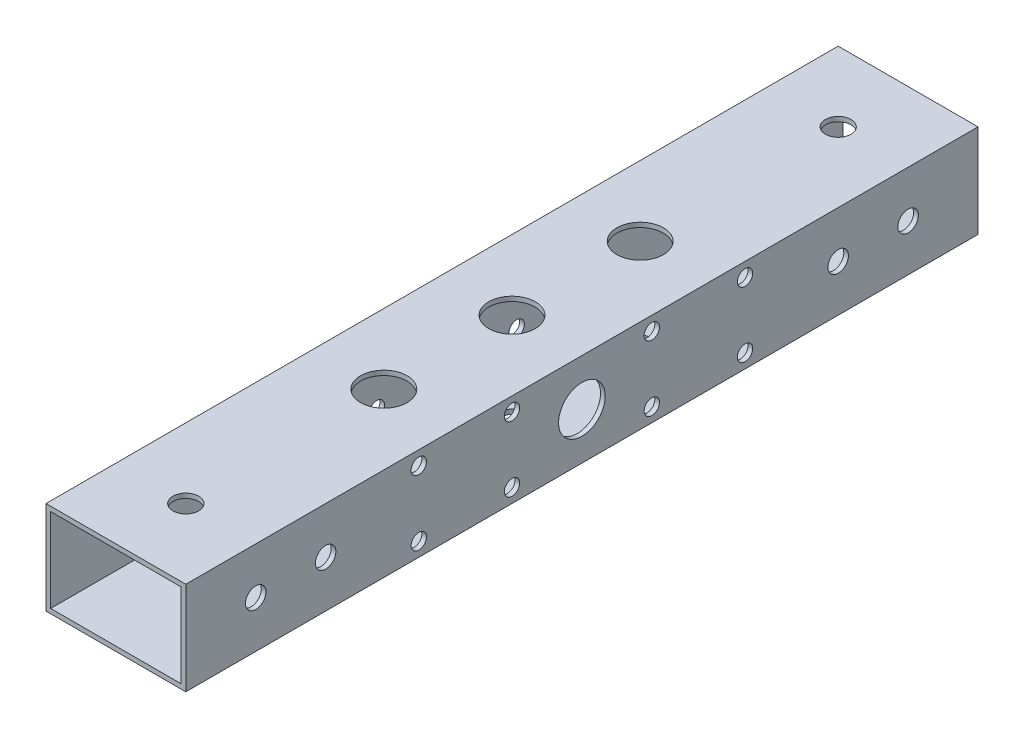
ISO-10303-21;
HEADER;
FILE_DESCRIPTION(('STEP AP214'),'2;1');
FILE_NAME('part.step','',(''),(''),'','','');
FILE_SCHEMA(('AUTOMOTIVE_DESIGN { 1 0 10303 214 1 1 1 1 }'));
ENDSEC;
DATA;
#1=APPLICATION_CONTEXT('core data for automotive mechanical design processes');
#2=APPLICATION_PROTOCOL_DEFINITION('international standard','automotive_design',2000,#1);
#3=PRODUCT_CONTEXT('',#1,'mechanical');
#4=PRODUCT('Part','Part','',(#3));
#5=PRODUCT_RELATED_PRODUCT_CATEGORY('part','',(#4));
#6=PRODUCT_DEFINITION_FORMATION('','',#4);
#7=PRODUCT_DEFINITION_CONTEXT('part definition',#1,'design');
#8=PRODUCT_DEFINITION('design','',#6,#7);
#9=PRODUCT_DEFINITION_SHAPE('','',#8);
#10=(LENGTH_UNIT() NAMED_UNIT(*) SI_UNIT(.MILLI.,.METRE.));
#11=(NAMED_UNIT(*) PLANE_ANGLE_UNIT() SI_UNIT($,.RADIAN.));
#12=(NAMED_UNIT(*) SI_UNIT($,.STERADIAN.) SOLID_ANGLE_UNIT());
#13=UNCERTAINTY_MEASURE_WITH_UNIT(LENGTH_MEASURE(1.E-05),#10,'distance_accuracy_value','');
#14=(GEOMETRIC_REPRESENTATION_CONTEXT(3) GLOBAL_UNCERTAINTY_ASSIGNED_CONTEXT((#13)) GLOBAL_UNIT_ASSIGNED_CONTEXT((#10,
#11,#12)) REPRESENTATION_CONTEXT('',''));
#15=CARTESIAN_POINT('',(0.,0.,0.));
#16=DIRECTION('',(0.,0.,1.));
#17=DIRECTION('',(1.,0.,0.));
#18=AXIS2_PLACEMENT_3D('',#15,#16,#17);
#19=CARTESIAN_POINT('',(-14.,-9.,170.));
#20=DIRECTION('',(0.,1.,0.));
#21=DIRECTION('',(1.,0.,0.));
#22=AXIS2_PLACEMENT_3D('',#19,#20,#21);
#23=PLANE('',#22);
#24=CARTESIAN_POINT('',(0.,-9.,85.));
#25=DIRECTION('',(0.,1.,0.));
#26=DIRECTION('',(0.,0.,1.));
#27=AXIS2_PLACEMENT_3D('',#24,#25,#26);
#28=CIRCLE('',#27,2.2);
#29=CARTESIAN_POINT('',(0.,-9.,87.2));
#30=VERTEX_POINT('',#29);
#31=EDGE_CURVE('E229',#30,#30,#28,.T.);
#32=ORIENTED_EDGE('',*,*,#31,.F.);
#33=EDGE_LOOP('',(#32));
#34=FACE_BOUND('',#33,.T.);
#35=CARTESIAN_POINT('',(0.,-9.,57.5));
#36=DIRECTION('',(0.,1.,0.));
#37=DIRECTION('',(0.,0.,1.));
#38=AXIS2_PLACEMENT_3D('',#35,#36,#37);
#39=CIRCLE('',#38,2.2);
#40=CARTESIAN_POINT('',(0.,-9.,59.7));
#41=VERTEX_POINT('',#40);
#42=EDGE_CURVE('E230',#41,#41,#39,.T.);
#43=ORIENTED_EDGE('',*,*,#42,.F.);
#44=EDGE_LOOP('',(#43));
#45=FACE_BOUND('',#44,.T.);
#46=CARTESIAN_POINT('',(0.,-9.,112.5));
#47=DIRECTION('',(0.,1.,0.));
#48=DIRECTION('',(0.,0.,1.));
#49=AXIS2_PLACEMENT_3D('',#46,#47,#48);
#50=CIRCLE('',#49,2.2);
#51=CARTESIAN_POINT('',(0.,-9.,114.7));
#52=VERTEX_POINT('',#51);
#53=EDGE_CURVE('E247',#52,#52,#50,.T.);
#54=ORIENTED_EDGE('',*,*,#53,.F.);
#55=EDGE_LOOP('',(#54));
#56=FACE_BOUND('',#55,.T.);
#57=DIRECTION('',(1.,0.,0.));
#58=VECTOR('',#57,1.);
#59=CARTESIAN_POINT('',(-14.,-9.,0.));
#60=LINE('',#59,#58);
#61=CARTESIAN_POINT('',(-14.,-9.,0.));
#62=VERTEX_POINT('',#61);
#63=CARTESIAN_POINT('',(14.,-9.,0.));
#64=VERTEX_POINT('',#63);
#65=EDGE_CURVE('E172',#62,#64,#60,.T.);
#66=ORIENTED_EDGE('',*,*,#65,.F.);
#67=DIRECTION('',(0.,0.,-1.));
#68=VECTOR('',#67,1.);
#69=CARTESIAN_POINT('',(-14.,-9.,170.));
#70=LINE('',#69,#68);
#71=CARTESIAN_POINT('',(-14.,-9.,170.));
#72=VERTEX_POINT('',#71);
#73=EDGE_CURVE('E11',#72,#62,#70,.T.);
#74=ORIENTED_EDGE('',*,*,#73,.F.);
#75=DIRECTION('',(1.,0.,0.));
#76=VECTOR('',#75,1.);
#77=CARTESIAN_POINT('',(-14.,-9.,170.));
#78=LINE('',#77,#76);
#79=CARTESIAN_POINT('',(14.,-9.,170.));
#80=VERTEX_POINT('',#79);
#81=EDGE_CURVE('E148',#72,#80,#78,.T.);
#82=ORIENTED_EDGE('',*,*,#81,.T.);
#83=DIRECTION('',(0.,0.,-1.));
#84=VECTOR('',#83,1.);
#85=CARTESIAN_POINT('',(14.,-9.,170.));
#86=LINE('',#85,#84);
#87=EDGE_CURVE('E192',#80,#64,#86,.T.);
#88=ORIENTED_EDGE('',*,*,#87,.T.);
#89=EDGE_LOOP('',(#66,#74,#82,#88));
#90=FACE_BOUND('',#89,.T.);
#91=ADVANCED_FACE('F17',(#34,#45,#56,#90),#23,.T.);
#92=CARTESIAN_POINT('',(-14.,-9.,170.));
#93=DIRECTION('',(1.,0.,0.));
#94=DIRECTION('',(0.,1.,0.));
#95=AXIS2_PLACEMENT_3D('',#92,#93,#94);
#96=PLANE('',#95);
#97=CARTESIAN_POINT('',(-14.,0.,15.));
#98=DIRECTION('',(1.,0.,0.));
#99=DIRECTION('',(0.,0.,-1.));
#100=AXIS2_PLACEMENT_3D('',#97,#98,#99);
#101=CIRCLE('',#100,2.2);
#102=CARTESIAN_POINT('',(-14.,0.,12.8));
#103=VERTEX_POINT('',#102);
#104=EDGE_CURVE('E139',#103,#103,#101,.T.);
#105=ORIENTED_EDGE('',*,*,#104,.F.);
#106=EDGE_LOOP('',(#105));
#107=FACE_BOUND('',#106,.T.);
#108=CARTESIAN_POINT('',(-14.,0.,30.));
#109=DIRECTION('',(1.,0.,0.));
#110=DIRECTION('',(0.,0.,-1.));
#111=AXIS2_PLACEMENT_3D('',#108,#109,#110);
#112=CIRCLE('',#111,2.2);
#113=CARTESIAN_POINT('',(-14.,0.,27.8));
#114=VERTEX_POINT('',#113);
#115=EDGE_CURVE('E295',#114,#114,#112,.T.);
#116=ORIENTED_EDGE('',*,*,#115,.F.);
#117=EDGE_LOOP('',(#116));
#118=FACE_BOUND('',#117,.T.);
#119=CARTESIAN_POINT('',(-14.,0.,140.));
#120=DIRECTION('',(1.,0.,0.));
#121=DIRECTION('',(0.,0.,-1.));
#122=AXIS2_PLACEMENT_3D('',#119,#120,#121);
#123=CIRCLE('',#122,2.2);
#124=CARTESIAN_POINT('',(-14.,0.,137.8));
#125=VERTEX_POINT('',#124);
#126=EDGE_CURVE('E296',#125,#125,#123,.T.);
#127=ORIENTED_EDGE('',*,*,#126,.F.);
#128=EDGE_LOOP('',(#127));
#129=FACE_BOUND('',#128,.T.);
#130=CARTESIAN_POINT('',(-14.,0.,155.));
#131=DIRECTION('',(1.,0.,0.));
#132=DIRECTION('',(0.,0.,-1.));
#133=AXIS2_PLACEMENT_3D('',#130,#131,#132);
#134=CIRCLE('',#133,2.2);
#135=CARTESIAN_POINT('',(-14.,0.,152.8));
#136=VERTEX_POINT('',#135);
#137=EDGE_CURVE('E262',#136,#136,#134,.T.);
#138=ORIENTED_EDGE('',*,*,#137,.F.);
#139=EDGE_LOOP('',(#138));
#140=FACE_BOUND('',#139,.T.);
#141=CARTESIAN_POINT('',(-14.,0.,85.));
#142=DIRECTION('',(1.,0.,0.));
#143=DIRECTION('',(0.,0.,-1.));
#144=AXIS2_PLACEMENT_3D('',#141,#142,#143);
#145=CIRCLE('',#144,5.);
#146=CARTESIAN_POINT('',(-14.,0.,80.));
#147=VERTEX_POINT('',#146);
#148=EDGE_CURVE('E334',#147,#147,#145,.T.);
#149=ORIENTED_EDGE('',*,*,#148,.F.);
#150=EDGE_LOOP('',(#149));
#151=FACE_BOUND('',#150,.T.);
#152=CARTESIAN_POINT('',(-14.,-7.,50.));
#153=DIRECTION('',(1.,0.,0.));
#154=DIRECTION('',(0.,0.,-1.));
#155=AXIS2_PLACEMENT_3D('',#152,#153,#154);
#156=CIRCLE('',#155,1.65);
#157=CARTESIAN_POINT('',(-14.,-7.,48.35));
#158=VERTEX_POINT('',#157);
#159=EDGE_CURVE('E447',#158,#158,#156,.T.);
#160=ORIENTED_EDGE('',*,*,#159,.F.);
#161=EDGE_LOOP('',(#160));
#162=FACE_BOUND('',#161,.T.);
#163=CARTESIAN_POINT('',(-14.,-7.,70.));
#164=DIRECTION('',(1.,0.,0.));
#165=DIRECTION('',(0.,0.,-1.));
#166=AXIS2_PLACEMENT_3D('',#163,#164,#165);
#167=CIRCLE('',#166,1.65);
#168=CARTESIAN_POINT('',(-14.,-7.,68.35));
#169=VERTEX_POINT('',#168);
#170=EDGE_CURVE('E439',#169,#169,#167,.T.);
#171=ORIENTED_EDGE('',*,*,#170,.F.);
#172=EDGE_LOOP('',(#171));
#173=FACE_BOUND('',#172,.T.);
#174=CARTESIAN_POINT('',(-14.,-7.,100.));
#175=DIRECTION('',(1.,0.,0.));
#176=DIRECTION('',(0.,0.,-1.));
#177=AXIS2_PLACEMENT_3D('',#174,#175,#176);
#178=CIRCLE('',#177,1.65);
#179=CARTESIAN_POINT('',(-14.,-7.,98.35));
#180=VERTEX_POINT('',#179);
#181=EDGE_CURVE('E431',#180,#180,#178,.T.);
#182=ORIENTED_EDGE('',*,*,#181,.F.);
#183=EDGE_LOOP('',(#182));
#184=FACE_BOUND('',#183,.T.);
#185=CARTESIAN_POINT('',(-14.,-7.,120.));
#186=DIRECTION('',(1.,0.,0.));
#187=DIRECTION('',(0.,0.,-1.));
#188=AXIS2_PLACEMENT_3D('',#185,#186,#187);
#189=CIRCLE('',#188,1.65);
#190=CARTESIAN_POINT('',(-14.,-7.,118.35));
#191=VERTEX_POINT('',#190);
#192=EDGE_CURVE('E420',#191,#191,#189,.T.);
#193=ORIENTED_EDGE('',*,*,#192,.F.);
#194=EDGE_LOOP('',(#193));
#195=FACE_BOUND('',#194,.T.);
#196=CARTESIAN_POINT('',(-14.,7.,120.));
#197=DIRECTION('',(1.,0.,0.));
#198=DIRECTION('',(0.,0.,-1.));
#199=AXIS2_PLACEMENT_3D('',#196,#197,#198);
#200=CIRCLE('',#199,1.65);
#201=CARTESIAN_POINT('',(-14.,7.,118.35));
#202=VERTEX_POINT('',#201);
#203=EDGE_CURVE('E412',#202,#202,#200,.T.);
#204=ORIENTED_EDGE('',*,*,#203,.F.);
#205=EDGE_LOOP('',(#204));
#206=FACE_BOUND('',#205,.T.);
#207=CARTESIAN_POINT('',(-14.,7.,100.));
#208=DIRECTION('',(1.,0.,0.));
#209=DIRECTION('',(0.,0.,-1.));
#210=AXIS2_PLACEMENT_3D('',#207,#208,#209);
#211=CIRCLE('',#210,1.65);
#212=CARTESIAN_POINT('',(-14.,7.,98.35));
#213=VERTEX_POINT('',#212);
#214=EDGE_CURVE('E400',#213,#213,#211,.T.);
#215=ORIENTED_EDGE('',*,*,#214,.F.);
#216=EDGE_LOOP('',(#215));
#217=FACE_BOUND('',#216,.T.);
#218=CARTESIAN_POINT('',(-14.,7.,70.));
#219=DIRECTION('',(1.,0.,0.));
#220=DIRECTION('',(0.,0.,-1.));
#221=AXIS2_PLACEMENT_3D('',#218,#219,#220);
#222=CIRCLE('',#221,1.65);
#223=CARTESIAN_POINT('',(-14.,7.,68.35));
#224=VERTEX_POINT('',#223);
#225=EDGE_CURVE('E322',#224,#224,#222,.T.);
#226=ORIENTED_EDGE('',*,*,#225,.F.);
#227=EDGE_LOOP('',(#226));
#228=FACE_BOUND('',#227,.T.);
#229=CARTESIAN_POINT('',(-14.,7.,50.));
#230=DIRECTION('',(1.,0.,0.));
#231=DIRECTION('',(0.,0.,-1.));
#232=AXIS2_PLACEMENT_3D('',#229,#230,#231);
#233=CIRCLE('',#232,1.65);
#234=CARTESIAN_POINT('',(-14.,7.,48.35));
#235=VERTEX_POINT('',#234);
#236=EDGE_CURVE('E323',#235,#235,#233,.T.);
#237=ORIENTED_EDGE('',*,*,#236,.F.);
#238=EDGE_LOOP('',(#237));
#239=FACE_BOUND('',#238,.T.);
#240=DIRECTION('',(0.,-1.,0.));
#241=VECTOR('',#240,1.);
#242=CARTESIAN_POINT('',(-14.,-9.,0.));
#243=LINE('',#242,#241);
#244=CARTESIAN_POINT('',(-14.,9.,0.));
#245=VERTEX_POINT('',#244);
#246=EDGE_CURVE('E181',#245,#62,#243,.T.);
#247=ORIENTED_EDGE('',*,*,#246,.F.);
#248=DIRECTION('',(0.,0.,-1.));
#249=VECTOR('',#248,1.);
#250=CARTESIAN_POINT('',(-14.,9.,170.));
#251=LINE('',#250,#249);
#252=CARTESIAN_POINT('',(-14.,9.,170.));
#253=VERTEX_POINT('',#252);
#254=EDGE_CURVE('E25',#253,#245,#251,.T.);
#255=ORIENTED_EDGE('',*,*,#254,.F.);
#256=DIRECTION('',(0.,-1.,0.));
#257=VECTOR('',#256,1.);
#258=CARTESIAN_POINT('',(-14.,-9.,170.));
#259=LINE('',#258,#257);
#260=EDGE_CURVE('E152',#253,#72,#259,.T.);
#261=ORIENTED_EDGE('',*,*,#260,.T.);
#262=ORIENTED_EDGE('',*,*,#73,.T.);
#263=EDGE_LOOP('',(#247,#255,#261,#262));
#264=FACE_BOUND('',#263,.T.);
#265=ADVANCED_FACE('F467',(#107,#118,#129,#140,#151,#162,#173,#184,#195,#206,#217,#228,#239,
#264),#96,.T.);
#266=CARTESIAN_POINT('',(-14.,9.,170.));
#267=DIRECTION('',(0.,-1.,0.));
#268=DIRECTION('',(0.,0.,-1.));
#269=AXIS2_PLACEMENT_3D('',#266,#267,#268);
#270=PLANE('',#269);
#271=CARTESIAN_POINT('',(0.,9.,112.5));
#272=DIRECTION('',(0.,-1.,0.));
#273=DIRECTION('',(0.,0.,-1.));
#274=AXIS2_PLACEMENT_3D('',#271,#272,#273);
#275=CIRCLE('',#274,5.);
#276=CARTESIAN_POINT('',(0.,9.,107.5));
#277=VERTEX_POINT('',#276);
#278=EDGE_CURVE('E234',#277,#277,#275,.T.);
#279=ORIENTED_EDGE('',*,*,#278,.F.);
#280=EDGE_LOOP('',(#279));
#281=FACE_BOUND('',#280,.T.);
#282=CARTESIAN_POINT('',(0.,9.,85.));
#283=DIRECTION('',(0.,-1.,0.));
#284=DIRECTION('',(0.,0.,-1.));
#285=AXIS2_PLACEMENT_3D('',#282,#283,#284);
#286=CIRCLE('',#285,5.);
#287=CARTESIAN_POINT('',(0.,9.,80.));
#288=VERTEX_POINT('',#287);
#289=EDGE_CURVE('E216',#288,#288,#286,.T.);
#290=ORIENTED_EDGE('',*,*,#289,.F.);
#291=EDGE_LOOP('',(#290));
#292=FACE_BOUND('',#291,.T.);
#293=CARTESIAN_POINT('',(0.,9.,57.5));
#294=DIRECTION('',(0.,-1.,0.));
#295=DIRECTION('',(0.,0.,-1.));
#296=AXIS2_PLACEMENT_3D('',#293,#294,#295);
#297=CIRCLE('',#296,5.);
#298=CARTESIAN_POINT('',(0.,9.,52.5));
#299=VERTEX_POINT('',#298);
#300=EDGE_CURVE('E215',#299,#299,#297,.T.);
#301=ORIENTED_EDGE('',*,*,#300,.F.);
#302=EDGE_LOOP('',(#301));
#303=FACE_BOUND('',#302,.T.);
#304=CARTESIAN_POINT('',(0.,9.,155.));
#305=DIRECTION('',(0.,-1.,0.));
#306=DIRECTION('',(0.,0.,-1.));
#307=AXIS2_PLACEMENT_3D('',#304,#305,#306);
#308=CIRCLE('',#307,2.75);
#309=CARTESIAN_POINT('',(0.,9.,152.25));
#310=VERTEX_POINT('',#309);
#311=EDGE_CURVE('E209',#310,#310,#308,.T.);
#312=ORIENTED_EDGE('',*,*,#311,.F.);
#313=EDGE_LOOP('',(#312));
#314=FACE_BOUND('',#313,.T.);
#315=CARTESIAN_POINT('',(0.,9.,15.));
#316=DIRECTION('',(0.,-1.,0.));
#317=DIRECTION('',(0.,0.,-1.));
#318=AXIS2_PLACEMENT_3D('',#315,#316,#317);
#319=CIRCLE('',#318,2.75);
#320=CARTESIAN_POINT('',(0.,9.,12.25));
#321=VERTEX_POINT('',#320);
#322=EDGE_CURVE('E210',#321,#321,#319,.T.);
#323=ORIENTED_EDGE('',*,*,#322,.F.);
#324=EDGE_LOOP('',(#323));
#325=FACE_BOUND('',#324,.T.);
#326=DIRECTION('',(-1.,0.,0.));
#327=VECTOR('',#326,1.);
#328=CARTESIAN_POINT('',(-14.,9.,0.));
#329=LINE('',#328,#327);
#330=CARTESIAN_POINT('',(14.,9.,0.));
#331=VERTEX_POINT('',#330);
#332=EDGE_CURVE('E177',#331,#245,#329,.T.);
#333=ORIENTED_EDGE('',*,*,#332,.F.);
#334=DIRECTION('',(0.,0.,-1.));
#335=VECTOR('',#334,1.);
#336=CARTESIAN_POINT('',(14.,9.,170.));
#337=LINE('',#336,#335);
#338=CARTESIAN_POINT('',(14.,9.,170.));
#339=VERTEX_POINT('',#338);
#340=EDGE_CURVE('E48',#339,#331,#337,.T.);
#341=ORIENTED_EDGE('',*,*,#340,.F.);
#342=DIRECTION('',(-1.,0.,0.));
#343=VECTOR('',#342,1.);
#344=CARTESIAN_POINT('',(-14.,9.,170.));
#345=LINE('',#344,#343);
#346=EDGE_CURVE('E156',#339,#253,#345,.T.);
#347=ORIENTED_EDGE('',*,*,#346,.T.);
#348=ORIENTED_EDGE('',*,*,#254,.T.);
#349=EDGE_LOOP('',(#333,#341,#347,#348));
#350=FACE_BOUND('',#349,.T.);
#351=ADVANCED_FACE('F464',(#281,#292,#303,#314,#325,#350),#270,.T.);
#352=CARTESIAN_POINT('',(14.,-9.,170.));
#353=DIRECTION('',(-1.,0.,0.));
#354=DIRECTION('',(0.,0.,1.));
#355=AXIS2_PLACEMENT_3D('',#352,#353,#354);
#356=PLANE('',#355);
#357=CARTESIAN_POINT('',(14.,0.,15.));
#358=DIRECTION('',(-1.,0.,0.));
#359=DIRECTION('',(0.,0.,1.));
#360=AXIS2_PLACEMENT_3D('',#357,#358,#359);
#361=CIRCLE('',#360,2.2);
#362=CARTESIAN_POINT('',(14.,0.,17.2));
#363=VERTEX_POINT('',#362);
#364=EDGE_CURVE('E275',#363,#363,#361,.T.);
#365=ORIENTED_EDGE('',*,*,#364,.F.);
#366=EDGE_LOOP('',(#365));
#367=FACE_BOUND('',#366,.T.);
#368=CARTESIAN_POINT('',(14.,0.,30.));
#369=DIRECTION('',(-1.,0.,0.));
#370=DIRECTION('',(0.,0.,1.));
#371=AXIS2_PLACEMENT_3D('',#368,#369,#370);
#372=CIRCLE('',#371,2.2);
#373=CARTESIAN_POINT('',(14.,0.,32.2));
#374=VERTEX_POINT('',#373);
#375=EDGE_CURVE('E280',#374,#374,#372,.T.);
#376=ORIENTED_EDGE('',*,*,#375,.F.);
#377=EDGE_LOOP('',(#376));
#378=FACE_BOUND('',#377,.T.);
#379=CARTESIAN_POINT('',(14.,0.,140.));
#380=DIRECTION('',(-1.,0.,0.));
#381=DIRECTION('',(0.,0.,1.));
#382=AXIS2_PLACEMENT_3D('',#379,#380,#381);
#383=CIRCLE('',#382,2.2);
#384=CARTESIAN_POINT('',(14.,0.,142.2));
#385=VERTEX_POINT('',#384);
#386=EDGE_CURVE('E281',#385,#385,#383,.T.);
#387=ORIENTED_EDGE('',*,*,#386,.F.);
#388=EDGE_LOOP('',(#387));
#389=FACE_BOUND('',#388,.T.);
#390=CARTESIAN_POINT('',(14.,0.,155.));
#391=DIRECTION('',(-1.,0.,0.));
#392=DIRECTION('',(0.,0.,1.));
#393=AXIS2_PLACEMENT_3D('',#390,#391,#392);
#394=CIRCLE('',#393,2.2);
#395=CARTESIAN_POINT('',(14.,0.,157.2));
#396=VERTEX_POINT('',#395);
#397=EDGE_CURVE('E243',#396,#396,#394,.T.);
#398=ORIENTED_EDGE('',*,*,#397,.F.);
#399=EDGE_LOOP('',(#398));
#400=FACE_BOUND('',#399,.T.);
#401=CARTESIAN_POINT('',(14.,0.,85.));
#402=DIRECTION('',(-1.,0.,0.));
#403=DIRECTION('',(0.,0.,1.));
#404=AXIS2_PLACEMENT_3D('',#401,#402,#403);
#405=CIRCLE('',#404,5.);
#406=CARTESIAN_POINT('',(14.,0.,90.));
#407=VERTEX_POINT('',#406);
#408=EDGE_CURVE('E377',#407,#407,#405,.T.);
#409=ORIENTED_EDGE('',*,*,#408,.F.);
#410=EDGE_LOOP('',(#409));
#411=FACE_BOUND('',#410,.T.);
#412=CARTESIAN_POINT('',(14.,-7.,50.));
#413=DIRECTION('',(-1.,0.,0.));
#414=DIRECTION('',(0.,0.,1.));
#415=AXIS2_PLACEMENT_3D('',#412,#413,#414);
#416=CIRCLE('',#415,1.65);
#417=CARTESIAN_POINT('',(14.,-7.,51.65));
#418=VERTEX_POINT('',#417);
#419=EDGE_CURVE('E328',#418,#418,#416,.T.);
#420=ORIENTED_EDGE('',*,*,#419,.F.);
#421=EDGE_LOOP('',(#420));
#422=FACE_BOUND('',#421,.T.);
#423=CARTESIAN_POINT('',(14.,-7.,70.));
#424=DIRECTION('',(-1.,0.,0.));
#425=DIRECTION('',(0.,0.,1.));
#426=AXIS2_PLACEMENT_3D('',#423,#424,#425);
#427=CIRCLE('',#426,1.65);
#428=CARTESIAN_POINT('',(14.,-7.,71.65));
#429=VERTEX_POINT('',#428);
#430=EDGE_CURVE('E329',#429,#429,#427,.T.);
#431=ORIENTED_EDGE('',*,*,#430,.F.);
#432=EDGE_LOOP('',(#431));
#433=FACE_BOUND('',#432,.T.);
#434=CARTESIAN_POINT('',(14.,-7.,100.));
#435=DIRECTION('',(-1.,0.,0.));
#436=DIRECTION('',(0.,0.,1.));
#437=AXIS2_PLACEMENT_3D('',#434,#435,#436);
#438=CIRCLE('',#437,1.65);
#439=CARTESIAN_POINT('',(14.,-7.,101.65));
#440=VERTEX_POINT('',#439);
#441=EDGE_CURVE('E360',#440,#440,#438,.T.);
#442=ORIENTED_EDGE('',*,*,#441,.F.);
#443=EDGE_LOOP('',(#442));
#444=FACE_BOUND('',#443,.T.);
#445=CARTESIAN_POINT('',(14.,-7.,120.));
#446=DIRECTION('',(-1.,0.,0.));
#447=DIRECTION('',(0.,0.,1.));
#448=AXIS2_PLACEMENT_3D('',#445,#446,#447);
#449=CIRCLE('',#448,1.65);
#450=CARTESIAN_POINT('',(14.,-7.,121.65));
#451=VERTEX_POINT('',#450);
#452=EDGE_CURVE('E355',#451,#451,#449,.T.);
#453=ORIENTED_EDGE('',*,*,#452,.F.);
#454=EDGE_LOOP('',(#453));
#455=FACE_BOUND('',#454,.T.);
#456=CARTESIAN_POINT('',(14.,7.,120.));
#457=DIRECTION('',(-1.,0.,0.));
#458=DIRECTION('',(0.,0.,1.));
#459=AXIS2_PLACEMENT_3D('',#456,#457,#458);
#460=CIRCLE('',#459,1.65);
#461=CARTESIAN_POINT('',(14.,7.,121.65));
#462=VERTEX_POINT('',#461);
#463=EDGE_CURVE('E347',#462,#462,#460,.T.);
#464=ORIENTED_EDGE('',*,*,#463,.F.);
#465=EDGE_LOOP('',(#464));
#466=FACE_BOUND('',#465,.T.);
#467=CARTESIAN_POINT('',(14.,7.,100.));
#468=DIRECTION('',(-1.,0.,0.));
#469=DIRECTION('',(0.,0.,1.));
#470=AXIS2_PLACEMENT_3D('',#467,#468,#469);
#471=CIRCLE('',#470,1.65);
#472=CARTESIAN_POINT('',(14.,7.,101.65));
#473=VERTEX_POINT('',#472);
#474=EDGE_CURVE('E339',#473,#473,#471,.T.);
#475=ORIENTED_EDGE('',*,*,#474,.F.);
#476=EDGE_LOOP('',(#475));
#477=FACE_BOUND('',#476,.T.);
#478=CARTESIAN_POINT('',(14.,7.,70.));
#479=DIRECTION('',(-1.,0.,0.));
#480=DIRECTION('',(0.,0.,1.));
#481=AXIS2_PLACEMENT_3D('',#478,#479,#480);
#482=CIRCLE('',#481,1.65);
#483=CARTESIAN_POINT('',(14.,7.,71.65));
#484=VERTEX_POINT('',#483);
#485=EDGE_CURVE('E316',#484,#484,#482,.T.);
#486=ORIENTED_EDGE('',*,*,#485,.F.);
#487=EDGE_LOOP('',(#486));
#488=FACE_BOUND('',#487,.T.);
#489=CARTESIAN_POINT('',(14.,7.,50.));
#490=DIRECTION('',(-1.,0.,0.));
#491=DIRECTION('',(0.,0.,1.));
#492=AXIS2_PLACEMENT_3D('',#489,#490,#491);
#493=CIRCLE('',#492,1.65);
#494=CARTESIAN_POINT('',(14.,7.,51.65));
#495=VERTEX_POINT('',#494);
#496=EDGE_CURVE('E649',#495,#495,#493,.T.);
#497=ORIENTED_EDGE('',*,*,#496,.F.);
#498=EDGE_LOOP('',(#497));
#499=FACE_BOUND('',#498,.T.);
#500=DIRECTION('',(0.,1.,0.));
#501=VECTOR('',#500,1.);
#502=CARTESIAN_POINT('',(14.,-9.,0.));
#503=LINE('',#502,#501);
#504=EDGE_CURVE('E173',#64,#331,#503,.T.);
#505=ORIENTED_EDGE('',*,*,#504,.F.);
#506=ORIENTED_EDGE('',*,*,#87,.F.);
#507=DIRECTION('',(0.,1.,0.));
#508=VECTOR('',#507,1.);
#509=CARTESIAN_POINT('',(14.,-9.,170.));
#510=LINE('',#509,#508);
#511=EDGE_CURVE('E145',#80,#339,#510,.T.);
#512=ORIENTED_EDGE('',*,*,#511,.T.);
#513=ORIENTED_EDGE('',*,*,#340,.T.);
#514=EDGE_LOOP('',(#505,#506,#512,#513));
#515=FACE_BOUND('',#514,.T.);
#516=ADVANCED_FACE('F466',(#367,#378,#389,#400,#411,#422,#433,#444,#455,#466,#477,#488,#499,
#515),#356,.T.);
#517=CARTESIAN_POINT('',(-15.,-10.,170.));
#518=DIRECTION('',(0.,1.,0.));
#519=DIRECTION('',(1.,0.,0.));
#520=AXIS2_PLACEMENT_3D('',#517,#518,#519);
#521=PLANE('',#520);
#522=CARTESIAN_POINT('',(0.,-10.,85.));
#523=DIRECTION('',(0.,1.,0.));
#524=DIRECTION('',(0.,0.,1.));
#525=AXIS2_PLACEMENT_3D('',#522,#523,#524);
#526=CIRCLE('',#525,2.2);
#527=CARTESIAN_POINT('',(0.,-10.,87.2));
#528=VERTEX_POINT('',#527);
#529=EDGE_CURVE('E225',#528,#528,#526,.T.);
#530=ORIENTED_EDGE('',*,*,#529,.T.);
#531=EDGE_LOOP('',(#530));
#532=FACE_BOUND('',#531,.T.);
#533=CARTESIAN_POINT('',(0.,-10.,57.5));
#534=DIRECTION('',(0.,1.,0.));
#535=DIRECTION('',(0.,0.,1.));
#536=AXIS2_PLACEMENT_3D('',#533,#534,#535);
#537=CIRCLE('',#536,2.2);
#538=CARTESIAN_POINT('',(0.,-10.,59.7));
#539=VERTEX_POINT('',#538);
#540=EDGE_CURVE('E251',#539,#539,#537,.T.);
#541=ORIENTED_EDGE('',*,*,#540,.T.);
#542=EDGE_LOOP('',(#541));
#543=FACE_BOUND('',#542,.T.);
#544=CARTESIAN_POINT('',(0.,-10.,112.5));
#545=DIRECTION('',(0.,1.,0.));
#546=DIRECTION('',(0.,0.,1.));
#547=AXIS2_PLACEMENT_3D('',#544,#545,#546);
#548=CIRCLE('',#547,2.2);
#549=CARTESIAN_POINT('',(0.,-10.,114.7));
#550=VERTEX_POINT('',#549);
#551=EDGE_CURVE('E239',#550,#550,#548,.T.);
#552=ORIENTED_EDGE('',*,*,#551,.T.);
#553=EDGE_LOOP('',(#552));
#554=FACE_BOUND('',#553,.T.);
#555=DIRECTION('',(1.,0.,0.));
#556=VECTOR('',#555,1.);
#557=CARTESIAN_POINT('',(-15.,-10.,0.));
#558=LINE('',#557,#556);
#559=CARTESIAN_POINT('',(-15.,-10.,0.));
#560=VERTEX_POINT('',#559);
#561=CARTESIAN_POINT('',(15.,-10.,0.));
#562=VERTEX_POINT('',#561);
#563=EDGE_CURVE('E163',#560,#562,#558,.T.);
#564=ORIENTED_EDGE('',*,*,#563,.T.);
#565=DIRECTION('',(0.,0.,-1.));
#566=VECTOR('',#565,1.);
#567=CARTESIAN_POINT('',(15.,-10.,170.));
#568=LINE('',#567,#566);
#569=CARTESIAN_POINT('',(15.,-10.,170.));
#570=VERTEX_POINT('',#569);
#571=EDGE_CURVE('E119',#570,#562,#568,.T.);
#572=ORIENTED_EDGE('',*,*,#571,.F.);
#573=DIRECTION('',(1.,0.,0.));
#574=VECTOR('',#573,1.);
#575=CARTESIAN_POINT('',(-15.,-10.,170.));
#576=LINE('',#575,#574);
#577=CARTESIAN_POINT('',(-15.,-10.,170.));
#578=VERTEX_POINT('',#577);
#579=EDGE_CURVE('E128',#578,#570,#576,.T.);
#580=ORIENTED_EDGE('',*,*,#579,.F.);
#581=DIRECTION('',(0.,0.,-1.));
#582=VECTOR('',#581,1.);
#583=CARTESIAN_POINT('',(-15.,-10.,170.));
#584=LINE('',#583,#582);
#585=EDGE_CURVE('E118',#578,#560,#584,.T.);
#586=ORIENTED_EDGE('',*,*,#585,.T.);
#587=EDGE_LOOP('',(#564,#572,#580,#586));
#588=FACE_BOUND('',#587,.T.);
#589=ADVANCED_FACE('F491',(#532,#543,#554,#588),#521,.F.);
#590=CARTESIAN_POINT('',(-15.,-10.,170.));
#591=DIRECTION('',(1.,0.,0.));
#592=DIRECTION('',(0.,1.,0.));
#593=AXIS2_PLACEMENT_3D('',#590,#591,#592);
#594=PLANE('',#593);
#595=CARTESIAN_POINT('',(-15.,0.,15.));
#596=DIRECTION('',(1.,0.,0.));
#597=DIRECTION('',(0.,0.,1.));
#598=AXIS2_PLACEMENT_3D('',#595,#596,#597);
#599=CIRCLE('',#598,2.2);
#600=CARTESIAN_POINT('',(-15.,0.,17.2));
#601=VERTEX_POINT('',#600);
#602=EDGE_CURVE('E297',#601,#601,#599,.T.);
#603=ORIENTED_EDGE('',*,*,#602,.T.);
#604=EDGE_LOOP('',(#603));
#605=FACE_BOUND('',#604,.T.);
#606=CARTESIAN_POINT('',(-15.,0.,30.));
#607=DIRECTION('',(1.,0.,0.));
#608=DIRECTION('',(0.,0.,1.));
#609=AXIS2_PLACEMENT_3D('',#606,#607,#608);
#610=CIRCLE('',#609,2.2);
#611=CARTESIAN_POINT('',(-15.,0.,32.2));
#612=VERTEX_POINT('',#611);
#613=EDGE_CURVE('E292',#612,#612,#610,.T.);
#614=ORIENTED_EDGE('',*,*,#613,.T.);
#615=EDGE_LOOP('',(#614));
#616=FACE_BOUND('',#615,.T.);
#617=CARTESIAN_POINT('',(-15.,0.,140.));
#618=DIRECTION('',(1.,0.,0.));
#619=DIRECTION('',(0.,0.,-1.));
#620=AXIS2_PLACEMENT_3D('',#617,#618,#619);
#621=CIRCLE('',#620,2.2);
#622=CARTESIAN_POINT('',(-15.,0.,137.8));
#623=VERTEX_POINT('',#622);
#624=EDGE_CURVE('E266',#623,#623,#621,.T.);
#625=ORIENTED_EDGE('',*,*,#624,.T.);
#626=EDGE_LOOP('',(#625));
#627=FACE_BOUND('',#626,.T.);
#628=CARTESIAN_POINT('',(-15.,0.,155.));
#629=DIRECTION('',(1.,0.,0.));
#630=DIRECTION('',(0.,0.,-1.));
#631=AXIS2_PLACEMENT_3D('',#628,#629,#630);
#632=CIRCLE('',#631,2.2);
#633=CARTESIAN_POINT('',(-15.,0.,152.8));
#634=VERTEX_POINT('',#633);
#635=EDGE_CURVE('E267',#634,#634,#632,.T.);
#636=ORIENTED_EDGE('',*,*,#635,.T.);
#637=EDGE_LOOP('',(#636));
#638=FACE_BOUND('',#637,.T.);
#639=CARTESIAN_POINT('',(-15.,0.,85.));
#640=DIRECTION('',(-1.,0.,0.));
#641=DIRECTION('',(0.,0.,1.));
#642=AXIS2_PLACEMENT_3D('',#639,#640,#641);
#643=CIRCLE('',#642,5.);
#644=CARTESIAN_POINT('',(-15.,0.,90.));
#645=VERTEX_POINT('',#644);
#646=EDGE_CURVE('E330',#645,#645,#643,.T.);
#647=ORIENTED_EDGE('',*,*,#646,.F.);
#648=EDGE_LOOP('',(#647));
#649=FACE_BOUND('',#648,.T.);
#650=CARTESIAN_POINT('',(-15.,-7.,50.));
#651=DIRECTION('',(-1.,0.,0.));
#652=DIRECTION('',(0.,0.,1.));
#653=AXIS2_PLACEMENT_3D('',#650,#651,#652);
#654=CIRCLE('',#653,1.65);
#655=CARTESIAN_POINT('',(-15.,-7.,51.65));
#656=VERTEX_POINT('',#655);
#657=EDGE_CURVE('E203',#656,#656,#654,.T.);
#658=ORIENTED_EDGE('',*,*,#657,.F.);
#659=EDGE_LOOP('',(#658));
#660=FACE_BOUND('',#659,.T.);
#661=CARTESIAN_POINT('',(-15.,-7.,70.));
#662=DIRECTION('',(-1.,0.,0.));
#663=DIRECTION('',(0.,0.,1.));
#664=AXIS2_PLACEMENT_3D('',#661,#662,#663);
#665=CIRCLE('',#664,1.65);
#666=CARTESIAN_POINT('',(-15.,-7.,71.65));
#667=VERTEX_POINT('',#666);
#668=EDGE_CURVE('E446',#667,#667,#665,.T.);
#669=ORIENTED_EDGE('',*,*,#668,.F.);
#670=EDGE_LOOP('',(#669));
#671=FACE_BOUND('',#670,.T.);
#672=CARTESIAN_POINT('',(-15.,-7.,100.));
#673=DIRECTION('',(-1.,0.,0.));
#674=DIRECTION('',(0.,0.,-1.));
#675=AXIS2_PLACEMENT_3D('',#672,#673,#674);
#676=CIRCLE('',#675,1.65);
#677=CARTESIAN_POINT('',(-15.,-7.,98.35));
#678=VERTEX_POINT('',#677);
#679=EDGE_CURVE('E435',#678,#678,#676,.T.);
#680=ORIENTED_EDGE('',*,*,#679,.F.);
#681=EDGE_LOOP('',(#680));
#682=FACE_BOUND('',#681,.T.);
#683=CARTESIAN_POINT('',(-15.,-7.,120.));
#684=DIRECTION('',(-1.,0.,0.));
#685=DIRECTION('',(0.,0.,-1.));
#686=AXIS2_PLACEMENT_3D('',#683,#684,#685);
#687=CIRCLE('',#686,1.65);
#688=CARTESIAN_POINT('',(-15.,-7.,118.35));
#689=VERTEX_POINT('',#688);
#690=EDGE_CURVE('E427',#689,#689,#687,.T.);
#691=ORIENTED_EDGE('',*,*,#690,.F.);
#692=EDGE_LOOP('',(#691));
#693=FACE_BOUND('',#692,.T.);
#694=CARTESIAN_POINT('',(-15.,7.,120.));
#695=DIRECTION('',(-1.,0.,0.));
#696=DIRECTION('',(0.,0.,1.));
#697=AXIS2_PLACEMENT_3D('',#694,#695,#696);
#698=CIRCLE('',#697,1.65);
#699=CARTESIAN_POINT('',(-15.,7.,121.65));
#700=VERTEX_POINT('',#699);
#701=EDGE_CURVE('E416',#700,#700,#698,.T.);
#702=ORIENTED_EDGE('',*,*,#701,.F.);
#703=EDGE_LOOP('',(#702));
#704=FACE_BOUND('',#703,.T.);
#705=CARTESIAN_POINT('',(-15.,7.,100.));
#706=DIRECTION('',(-1.,0.,0.));
#707=DIRECTION('',(0.,0.,1.));
#708=AXIS2_PLACEMENT_3D('',#705,#706,#707);
#709=CIRCLE('',#708,1.65);
#710=CARTESIAN_POINT('',(-15.,7.,101.65));
#711=VERTEX_POINT('',#710);
#712=EDGE_CURVE('E404',#711,#711,#709,.T.);
#713=ORIENTED_EDGE('',*,*,#712,.F.);
#714=EDGE_LOOP('',(#713));
#715=FACE_BOUND('',#714,.T.);
#716=CARTESIAN_POINT('',(-15.,7.,70.));
#717=DIRECTION('',(-1.,0.,0.));
#718=DIRECTION('',(0.,0.,-1.));
#719=AXIS2_PLACEMENT_3D('',#716,#717,#718);
#720=CIRCLE('',#719,1.65);
#721=CARTESIAN_POINT('',(-15.,7.,68.35));
#722=VERTEX_POINT('',#721);
#723=EDGE_CURVE('E405',#722,#722,#720,.T.);
#724=ORIENTED_EDGE('',*,*,#723,.F.);
#725=EDGE_LOOP('',(#724));
#726=FACE_BOUND('',#725,.T.);
#727=CARTESIAN_POINT('',(-15.,7.,50.));
#728=DIRECTION('',(-1.,0.,0.));
#729=DIRECTION('',(0.,0.,-1.));
#730=AXIS2_PLACEMENT_3D('',#727,#728,#729);
#731=CIRCLE('',#730,1.65);
#732=CARTESIAN_POINT('',(-15.,7.,48.35));
#733=VERTEX_POINT('',#732);
#734=EDGE_CURVE('E318',#733,#733,#731,.T.);
#735=ORIENTED_EDGE('',*,*,#734,.F.);
#736=EDGE_LOOP('',(#735));
#737=FACE_BOUND('',#736,.T.);
#738=DIRECTION('',(0.,-1.,0.));
#739=VECTOR('',#738,1.);
#740=CARTESIAN_POINT('',(-15.,-10.,0.));
#741=LINE('',#740,#739);
#742=CARTESIAN_POINT('',(-15.,10.,0.));
#743=VERTEX_POINT('',#742);
#744=EDGE_CURVE('E167',#743,#560,#741,.T.);
#745=ORIENTED_EDGE('',*,*,#744,.T.);
#746=ORIENTED_EDGE('',*,*,#585,.F.);
#747=DIRECTION('',(0.,-1.,0.));
#748=VECTOR('',#747,1.);
#749=CARTESIAN_POINT('',(-15.,-10.,170.));
#750=LINE('',#749,#748);
#751=CARTESIAN_POINT('',(-15.,10.,170.));
#752=VERTEX_POINT('',#751);
#753=EDGE_CURVE('E122',#752,#578,#750,.T.);
#754=ORIENTED_EDGE('',*,*,#753,.F.);
#755=DIRECTION('',(0.,0.,-1.));
#756=VECTOR('',#755,1.);
#757=CARTESIAN_POINT('',(-15.,10.,170.));
#758=LINE('',#757,#756);
#759=EDGE_CURVE('E106',#752,#743,#758,.T.);
#760=ORIENTED_EDGE('',*,*,#759,.T.);
#761=EDGE_LOOP('',(#745,#746,#754,#760));
#762=FACE_BOUND('',#761,.T.);
#763=ADVANCED_FACE('F123',(#605,#616,#627,#638,#649,#660,#671,#682,#693,#704,#715,#726,#737,
#762),#594,.F.);
#764=CARTESIAN_POINT('',(-15.,10.,170.));
#765=DIRECTION('',(0.,-1.,0.));
#766=DIRECTION('',(0.,0.,-1.));
#767=AXIS2_PLACEMENT_3D('',#764,#765,#766);
#768=PLANE('',#767);
#769=CARTESIAN_POINT('',(0.,10.,112.5));
#770=DIRECTION('',(0.,1.,0.));
#771=DIRECTION('',(0.,0.,1.));
#772=AXIS2_PLACEMENT_3D('',#769,#770,#771);
#773=CIRCLE('',#772,5.);
#774=CARTESIAN_POINT('',(0.,10.,117.5));
#775=VERTEX_POINT('',#774);
#776=EDGE_CURVE('E235',#775,#775,#773,.T.);
#777=ORIENTED_EDGE('',*,*,#776,.F.);
#778=EDGE_LOOP('',(#777));
#779=FACE_BOUND('',#778,.T.);
#780=CARTESIAN_POINT('',(0.,10.,85.));
#781=DIRECTION('',(0.,1.,0.));
#782=DIRECTION('',(0.,0.,1.));
#783=AXIS2_PLACEMENT_3D('',#780,#781,#782);
#784=CIRCLE('',#783,5.);
#785=CARTESIAN_POINT('',(0.,10.,90.));
#786=VERTEX_POINT('',#785);
#787=EDGE_CURVE('E220',#786,#786,#784,.T.);
#788=ORIENTED_EDGE('',*,*,#787,.F.);
#789=EDGE_LOOP('',(#788));
#790=FACE_BOUND('',#789,.T.);
#791=CARTESIAN_POINT('',(0.,10.,57.5));
#792=DIRECTION('',(0.,1.,0.));
#793=DIRECTION('',(0.,0.,1.));
#794=AXIS2_PLACEMENT_3D('',#791,#792,#793);
#795=CIRCLE('',#794,5.);
#796=CARTESIAN_POINT('',(0.,10.,62.5));
#797=VERTEX_POINT('',#796);
#798=EDGE_CURVE('E221',#797,#797,#795,.T.);
#799=ORIENTED_EDGE('',*,*,#798,.F.);
#800=EDGE_LOOP('',(#799));
#801=FACE_BOUND('',#800,.T.);
#802=CARTESIAN_POINT('',(0.,10.,155.));
#803=DIRECTION('',(0.,1.,0.));
#804=DIRECTION('',(0.,0.,1.));
#805=AXIS2_PLACEMENT_3D('',#802,#803,#804);
#806=CIRCLE('',#805,2.75);
#807=CARTESIAN_POINT('',(0.,10.,157.75));
#808=VERTEX_POINT('',#807);
#809=EDGE_CURVE('E211',#808,#808,#806,.T.);
#810=ORIENTED_EDGE('',*,*,#809,.F.);
#811=EDGE_LOOP('',(#810));
#812=FACE_BOUND('',#811,.T.);
#813=CARTESIAN_POINT('',(0.,10.,15.));
#814=DIRECTION('',(0.,1.,0.));
#815=DIRECTION('',(0.,0.,1.));
#816=AXIS2_PLACEMENT_3D('',#813,#814,#815);
#817=CIRCLE('',#816,2.75);
#818=CARTESIAN_POINT('',(0.,10.,17.75));
#819=VERTEX_POINT('',#818);
#820=EDGE_CURVE('E205',#819,#819,#817,.T.);
#821=ORIENTED_EDGE('',*,*,#820,.F.);
#822=EDGE_LOOP('',(#821));
#823=FACE_BOUND('',#822,.T.);
#824=DIRECTION('',(-1.,0.,0.));
#825=VECTOR('',#824,1.);
#826=CARTESIAN_POINT('',(-15.,10.,0.));
#827=LINE('',#826,#825);
#828=CARTESIAN_POINT('',(15.,10.,0.));
#829=VERTEX_POINT('',#828);
#830=EDGE_CURVE('E113',#829,#743,#827,.T.);
#831=ORIENTED_EDGE('',*,*,#830,.T.);
#832=ORIENTED_EDGE('',*,*,#759,.F.);
#833=DIRECTION('',(-1.,0.,0.));
#834=VECTOR('',#833,1.);
#835=CARTESIAN_POINT('',(-15.,10.,170.));
#836=LINE('',#835,#834);
#837=CARTESIAN_POINT('',(15.,10.,170.));
#838=VERTEX_POINT('',#837);
#839=EDGE_CURVE('E110',#838,#752,#836,.T.);
#840=ORIENTED_EDGE('',*,*,#839,.F.);
#841=DIRECTION('',(0.,0.,-1.));
#842=VECTOR('',#841,1.);
#843=CARTESIAN_POINT('',(15.,10.,170.));
#844=LINE('',#843,#842);
#845=EDGE_CURVE('E185',#838,#829,#844,.T.);
#846=ORIENTED_EDGE('',*,*,#845,.T.);
#847=EDGE_LOOP('',(#831,#832,#840,#846));
#848=FACE_BOUND('',#847,.T.);
#849=ADVANCED_FACE('F108',(#779,#790,#801,#812,#823,#848),#768,.F.);
#850=CARTESIAN_POINT('',(15.,-10.,170.));
#851=DIRECTION('',(-1.,0.,0.));
#852=DIRECTION('',(0.,0.,1.));
#853=AXIS2_PLACEMENT_3D('',#850,#851,#852);
#854=PLANE('',#853);
#855=CARTESIAN_POINT('',(15.,0.,15.));
#856=DIRECTION('',(1.,0.,0.));
#857=DIRECTION('',(0.,0.,1.));
#858=AXIS2_PLACEMENT_3D('',#855,#856,#857);
#859=CIRCLE('',#858,2.2);
#860=CARTESIAN_POINT('',(15.,0.,17.2));
#861=VERTEX_POINT('',#860);
#862=EDGE_CURVE('E271',#861,#861,#859,.T.);
#863=ORIENTED_EDGE('',*,*,#862,.F.);
#864=EDGE_LOOP('',(#863));
#865=FACE_BOUND('',#864,.T.);
#866=CARTESIAN_POINT('',(15.,0.,30.));
#867=DIRECTION('',(1.,0.,0.));
#868=DIRECTION('',(0.,0.,1.));
#869=AXIS2_PLACEMENT_3D('',#866,#867,#868);
#870=CIRCLE('',#869,2.2);
#871=CARTESIAN_POINT('',(15.,0.,32.2));
#872=VERTEX_POINT('',#871);
#873=EDGE_CURVE('E285',#872,#872,#870,.T.);
#874=ORIENTED_EDGE('',*,*,#873,.F.);
#875=EDGE_LOOP('',(#874));
#876=FACE_BOUND('',#875,.T.);
#877=CARTESIAN_POINT('',(15.,0.,140.));
#878=DIRECTION('',(1.,0.,0.));
#879=DIRECTION('',(0.,0.,-1.));
#880=AXIS2_PLACEMENT_3D('',#877,#878,#879);
#881=CIRCLE('',#880,2.2);
#882=CARTESIAN_POINT('',(15.,0.,137.8));
#883=VERTEX_POINT('',#882);
#884=EDGE_CURVE('E276',#883,#883,#881,.T.);
#885=ORIENTED_EDGE('',*,*,#884,.F.);
#886=EDGE_LOOP('',(#885));
#887=FACE_BOUND('',#886,.T.);
#888=CARTESIAN_POINT('',(15.,0.,155.));
#889=DIRECTION('',(1.,0.,0.));
#890=DIRECTION('',(0.,0.,-1.));
#891=AXIS2_PLACEMENT_3D('',#888,#889,#890);
#892=CIRCLE('',#891,2.2);
#893=CARTESIAN_POINT('',(15.,0.,152.8));
#894=VERTEX_POINT('',#893);
#895=EDGE_CURVE('E261',#894,#894,#892,.T.);
#896=ORIENTED_EDGE('',*,*,#895,.F.);
#897=EDGE_LOOP('',(#896));
#898=FACE_BOUND('',#897,.T.);
#899=CARTESIAN_POINT('',(15.,0.,85.));
#900=DIRECTION('',(-1.,0.,0.));
#901=DIRECTION('',(0.,0.,1.));
#902=AXIS2_PLACEMENT_3D('',#899,#900,#901);
#903=CIRCLE('',#902,5.);
#904=CARTESIAN_POINT('',(15.,0.,90.));
#905=VERTEX_POINT('',#904);
#906=EDGE_CURVE('E381',#905,#905,#903,.T.);
#907=ORIENTED_EDGE('',*,*,#906,.T.);
#908=EDGE_LOOP('',(#907));
#909=FACE_BOUND('',#908,.T.);
#910=CARTESIAN_POINT('',(15.,-7.,50.));
#911=DIRECTION('',(-1.,0.,0.));
#912=DIRECTION('',(0.,0.,1.));
#913=AXIS2_PLACEMENT_3D('',#910,#911,#912);
#914=CIRCLE('',#913,1.65);
#915=CARTESIAN_POINT('',(15.,-7.,51.65));
#916=VERTEX_POINT('',#915);
#917=EDGE_CURVE('E324',#916,#916,#914,.T.);
#918=ORIENTED_EDGE('',*,*,#917,.T.);
#919=EDGE_LOOP('',(#918));
#920=FACE_BOUND('',#919,.T.);
#921=CARTESIAN_POINT('',(15.,-7.,70.));
#922=DIRECTION('',(-1.,0.,0.));
#923=DIRECTION('',(0.,0.,1.));
#924=AXIS2_PLACEMENT_3D('',#921,#922,#923);
#925=CIRCLE('',#924,1.65);
#926=CARTESIAN_POINT('',(15.,-7.,71.65));
#927=VERTEX_POINT('',#926);
#928=EDGE_CURVE('E364',#927,#927,#925,.T.);
#929=ORIENTED_EDGE('',*,*,#928,.T.);
#930=EDGE_LOOP('',(#929));
#931=FACE_BOUND('',#930,.T.);
#932=CARTESIAN_POINT('',(15.,-7.,100.));
#933=DIRECTION('',(-1.,0.,0.));
#934=DIRECTION('',(0.,0.,-1.));
#935=AXIS2_PLACEMENT_3D('',#932,#933,#934);
#936=CIRCLE('',#935,1.65);
#937=CARTESIAN_POINT('',(15.,-7.,98.35));
#938=VERTEX_POINT('',#937);
#939=EDGE_CURVE('E359',#938,#938,#936,.T.);
#940=ORIENTED_EDGE('',*,*,#939,.T.);
#941=EDGE_LOOP('',(#940));
#942=FACE_BOUND('',#941,.T.);
#943=CARTESIAN_POINT('',(15.,-7.,120.));
#944=DIRECTION('',(-1.,0.,0.));
#945=DIRECTION('',(0.,0.,-1.));
#946=AXIS2_PLACEMENT_3D('',#943,#944,#945);
#947=CIRCLE('',#946,1.65);
#948=CARTESIAN_POINT('',(15.,-7.,118.35));
#949=VERTEX_POINT('',#948);
#950=EDGE_CURVE('E351',#949,#949,#947,.T.);
#951=ORIENTED_EDGE('',*,*,#950,.T.);
#952=EDGE_LOOP('',(#951));
#953=FACE_BOUND('',#952,.T.);
#954=CARTESIAN_POINT('',(15.,7.,120.));
#955=DIRECTION('',(-1.,0.,0.));
#956=DIRECTION('',(0.,0.,1.));
#957=AXIS2_PLACEMENT_3D('',#954,#955,#956);
#958=CIRCLE('',#957,1.65);
#959=CARTESIAN_POINT('',(15.,7.,121.65));
#960=VERTEX_POINT('',#959);
#961=EDGE_CURVE('E343',#960,#960,#958,.T.);
#962=ORIENTED_EDGE('',*,*,#961,.T.);
#963=EDGE_LOOP('',(#962));
#964=FACE_BOUND('',#963,.T.);
#965=CARTESIAN_POINT('',(15.,7.,100.));
#966=DIRECTION('',(-1.,0.,0.));
#967=DIRECTION('',(0.,0.,1.));
#968=AXIS2_PLACEMENT_3D('',#965,#966,#967);
#969=CIRCLE('',#968,1.65);
#970=CARTESIAN_POINT('',(15.,7.,101.65));
#971=VERTEX_POINT('',#970);
#972=EDGE_CURVE('E335',#971,#971,#969,.T.);
#973=ORIENTED_EDGE('',*,*,#972,.T.);
#974=EDGE_LOOP('',(#973));
#975=FACE_BOUND('',#974,.T.);
#976=CARTESIAN_POINT('',(15.,7.,70.));
#977=DIRECTION('',(-1.,0.,0.));
#978=DIRECTION('',(0.,0.,-1.));
#979=AXIS2_PLACEMENT_3D('',#976,#977,#978);
#980=CIRCLE('',#979,1.65);
#981=CARTESIAN_POINT('',(15.,7.,68.35));
#982=VERTEX_POINT('',#981);
#983=EDGE_CURVE('E659',#982,#982,#980,.T.);
#984=ORIENTED_EDGE('',*,*,#983,.T.);
#985=EDGE_LOOP('',(#984));
#986=FACE_BOUND('',#985,.T.);
#987=CARTESIAN_POINT('',(15.,7.,50.));
#988=DIRECTION('',(-1.,0.,0.));
#989=DIRECTION('',(0.,0.,-1.));
#990=AXIS2_PLACEMENT_3D('',#987,#988,#989);
#991=CIRCLE('',#990,1.65);
#992=CARTESIAN_POINT('',(15.,7.,48.35));
#993=VERTEX_POINT('',#992);
#994=EDGE_CURVE('E652',#993,#993,#991,.T.);
#995=ORIENTED_EDGE('',*,*,#994,.T.);
#996=EDGE_LOOP('',(#995));
#997=FACE_BOUND('',#996,.T.);
#998=DIRECTION('',(0.,1.,0.));
#999=VECTOR('',#998,1.);
#1000=CARTESIAN_POINT('',(15.,-10.,0.));
#1001=LINE('',#1000,#999);
#1002=EDGE_CURVE('E159',#562,#829,#1001,.T.);
#1003=ORIENTED_EDGE('',*,*,#1002,.T.);
#1004=ORIENTED_EDGE('',*,*,#845,.F.);
#1005=DIRECTION('',(0.,1.,0.));
#1006=VECTOR('',#1005,1.);
#1007=CARTESIAN_POINT('',(15.,-10.,170.));
#1008=LINE('',#1007,#1006);
#1009=EDGE_CURVE('E132',#570,#838,#1008,.T.);
#1010=ORIENTED_EDGE('',*,*,#1009,.F.);
#1011=ORIENTED_EDGE('',*,*,#571,.T.);
#1012=EDGE_LOOP('',(#1003,#1004,#1010,#1011));
#1013=FACE_BOUND('',#1012,.T.);
#1014=ADVANCED_FACE('F499',(#865,#876,#887,#898,#909,#920,#931,#942,#953,#964,#975,#986,#997,
#1013),#854,.F.);
#1015=CARTESIAN_POINT('',(0.,0.,0.));
#1016=DIRECTION('',(0.,0.,-1.));
#1017=DIRECTION('',(0.,-1.,0.));
#1018=AXIS2_PLACEMENT_3D('',#1015,#1016,#1017);
#1019=PLANE('',#1018);
#1020=ORIENTED_EDGE('',*,*,#65,.T.);
#1021=ORIENTED_EDGE('',*,*,#504,.T.);
#1022=ORIENTED_EDGE('',*,*,#332,.T.);
#1023=ORIENTED_EDGE('',*,*,#246,.T.);
#1024=EDGE_LOOP('',(#1020,#1021,#1022,#1023));
#1025=FACE_BOUND('',#1024,.T.);
#1026=ORIENTED_EDGE('',*,*,#1002,.F.);
#1027=ORIENTED_EDGE('',*,*,#563,.F.);
#1028=ORIENTED_EDGE('',*,*,#744,.F.);
#1029=ORIENTED_EDGE('',*,*,#830,.F.);
#1030=EDGE_LOOP('',(#1026,#1027,#1028,#1029));
#1031=FACE_BOUND('',#1030,.T.);
#1032=ADVANCED_FACE('F472',(#1025,#1031),#1019,.T.);
#1033=CARTESIAN_POINT('',(0.,0.,170.));
#1034=DIRECTION('',(0.,0.,-1.));
#1035=DIRECTION('',(0.,-1.,0.));
#1036=AXIS2_PLACEMENT_3D('',#1033,#1034,#1035);
#1037=PLANE('',#1036);
#1038=ORIENTED_EDGE('',*,*,#511,.F.);
#1039=ORIENTED_EDGE('',*,*,#81,.F.);
#1040=ORIENTED_EDGE('',*,*,#260,.F.);
#1041=ORIENTED_EDGE('',*,*,#346,.F.);
#1042=EDGE_LOOP('',(#1038,#1039,#1040,#1041));
#1043=FACE_BOUND('',#1042,.T.);
#1044=ORIENTED_EDGE('',*,*,#1009,.T.);
#1045=ORIENTED_EDGE('',*,*,#839,.T.);
#1046=ORIENTED_EDGE('',*,*,#753,.T.);
#1047=ORIENTED_EDGE('',*,*,#579,.T.);
#1048=EDGE_LOOP('',(#1044,#1045,#1046,#1047));
#1049=FACE_BOUND('',#1048,.T.);
#1050=ADVANCED_FACE('F130',(#1043,#1049),#1037,.F.);
#1051=CARTESIAN_POINT('',(-15.,0.,15.));
#1052=DIRECTION('',(1.,0.,0.));
#1053=DIRECTION('',(0.,0.,-1.));
#1054=AXIS2_PLACEMENT_3D('',#1051,#1052,#1053);
#1055=CYLINDRICAL_SURFACE('',#1054,2.2);
#1056=ORIENTED_EDGE('',*,*,#104,.T.);
#1057=EDGE_LOOP('',(#1056));
#1058=FACE_BOUND('',#1057,.T.);
#1059=ORIENTED_EDGE('',*,*,#602,.F.);
#1060=EDGE_LOOP('',(#1059));
#1061=FACE_BOUND('',#1060,.T.);
#1062=ADVANCED_FACE('F504',(#1058,#1061),#1055,.F.);
#1063=CARTESIAN_POINT('',(-15.,0.,30.));
#1064=DIRECTION('',(1.,0.,0.));
#1065=DIRECTION('',(0.,0.,-1.));
#1066=AXIS2_PLACEMENT_3D('',#1063,#1064,#1065);
#1067=CYLINDRICAL_SURFACE('',#1066,2.2);
#1068=ORIENTED_EDGE('',*,*,#115,.T.);
#1069=EDGE_LOOP('',(#1068));
#1070=FACE_BOUND('',#1069,.T.);
#1071=ORIENTED_EDGE('',*,*,#613,.F.);
#1072=EDGE_LOOP('',(#1071));
#1073=FACE_BOUND('',#1072,.T.);
#1074=ADVANCED_FACE('F507',(#1070,#1073),#1067,.F.);
#1075=CARTESIAN_POINT('',(-15.,0.,140.));
#1076=DIRECTION('',(1.,0.,0.));
#1077=DIRECTION('',(0.,0.,-1.));
#1078=AXIS2_PLACEMENT_3D('',#1075,#1076,#1077);
#1079=CYLINDRICAL_SURFACE('',#1078,2.2);
#1080=ORIENTED_EDGE('',*,*,#126,.T.);
#1081=EDGE_LOOP('',(#1080));
#1082=FACE_BOUND('',#1081,.T.);
#1083=ORIENTED_EDGE('',*,*,#624,.F.);
#1084=EDGE_LOOP('',(#1083));
#1085=FACE_BOUND('',#1084,.T.);
#1086=ADVANCED_FACE('F514',(#1082,#1085),#1079,.F.);
#1087=CARTESIAN_POINT('',(-15.,0.,155.));
#1088=DIRECTION('',(1.,0.,0.));
#1089=DIRECTION('',(0.,0.,-1.));
#1090=AXIS2_PLACEMENT_3D('',#1087,#1088,#1089);
#1091=CYLINDRICAL_SURFACE('',#1090,2.2);
#1092=ORIENTED_EDGE('',*,*,#137,.T.);
#1093=EDGE_LOOP('',(#1092));
#1094=FACE_BOUND('',#1093,.T.);
#1095=ORIENTED_EDGE('',*,*,#635,.F.);
#1096=EDGE_LOOP('',(#1095));
#1097=FACE_BOUND('',#1096,.T.);
#1098=ADVANCED_FACE('F517',(#1094,#1097),#1091,.F.);
#1099=CARTESIAN_POINT('',(-15.,0.,15.));
#1100=DIRECTION('',(1.,0.,0.));
#1101=DIRECTION('',(0.,0.,-1.));
#1102=AXIS2_PLACEMENT_3D('',#1099,#1100,#1101);
#1103=CYLINDRICAL_SURFACE('',#1102,2.2);
#1104=ORIENTED_EDGE('',*,*,#862,.T.);
#1105=EDGE_LOOP('',(#1104));
#1106=FACE_BOUND('',#1105,.T.);
#1107=ORIENTED_EDGE('',*,*,#364,.T.);
#1108=EDGE_LOOP('',(#1107));
#1109=FACE_BOUND('',#1108,.T.);
#1110=ADVANCED_FACE('F521',(#1106,#1109),#1103,.F.);
#1111=CARTESIAN_POINT('',(-15.,0.,30.));
#1112=DIRECTION('',(1.,0.,0.));
#1113=DIRECTION('',(0.,0.,-1.));
#1114=AXIS2_PLACEMENT_3D('',#1111,#1112,#1113);
#1115=CYLINDRICAL_SURFACE('',#1114,2.2);
#1116=ORIENTED_EDGE('',*,*,#873,.T.);
#1117=EDGE_LOOP('',(#1116));
#1118=FACE_BOUND('',#1117,.T.);
#1119=ORIENTED_EDGE('',*,*,#375,.T.);
#1120=EDGE_LOOP('',(#1119));
#1121=FACE_BOUND('',#1120,.T.);
#1122=ADVANCED_FACE('F523',(#1118,#1121),#1115,.F.);
#1123=CARTESIAN_POINT('',(-15.,0.,140.));
#1124=DIRECTION('',(1.,0.,0.));
#1125=DIRECTION('',(0.,0.,-1.));
#1126=AXIS2_PLACEMENT_3D('',#1123,#1124,#1125);
#1127=CYLINDRICAL_SURFACE('',#1126,2.2);
#1128=ORIENTED_EDGE('',*,*,#884,.T.);
#1129=EDGE_LOOP('',(#1128));
#1130=FACE_BOUND('',#1129,.T.);
#1131=ORIENTED_EDGE('',*,*,#386,.T.);
#1132=EDGE_LOOP('',(#1131));
#1133=FACE_BOUND('',#1132,.T.);
#1134=ADVANCED_FACE('F526',(#1130,#1133),#1127,.F.);
#1135=CARTESIAN_POINT('',(-15.,0.,155.));
#1136=DIRECTION('',(1.,0.,0.));
#1137=DIRECTION('',(0.,0.,-1.));
#1138=AXIS2_PLACEMENT_3D('',#1135,#1136,#1137);
#1139=CYLINDRICAL_SURFACE('',#1138,2.2);
#1140=ORIENTED_EDGE('',*,*,#895,.T.);
#1141=EDGE_LOOP('',(#1140));
#1142=FACE_BOUND('',#1141,.T.);
#1143=ORIENTED_EDGE('',*,*,#397,.T.);
#1144=EDGE_LOOP('',(#1143));
#1145=FACE_BOUND('',#1144,.T.);
#1146=ADVANCED_FACE('F530',(#1142,#1145),#1139,.F.);
#1147=CARTESIAN_POINT('',(0.,-10.,85.));
#1148=DIRECTION('',(0.,1.,0.));
#1149=DIRECTION('',(0.,0.,1.));
#1150=AXIS2_PLACEMENT_3D('',#1147,#1148,#1149);
#1151=CYLINDRICAL_SURFACE('',#1150,2.2);
#1152=ORIENTED_EDGE('',*,*,#31,.T.);
#1153=EDGE_LOOP('',(#1152));
#1154=FACE_BOUND('',#1153,.T.);
#1155=ORIENTED_EDGE('',*,*,#529,.F.);
#1156=EDGE_LOOP('',(#1155));
#1157=FACE_BOUND('',#1156,.T.);
#1158=ADVANCED_FACE('F534',(#1154,#1157),#1151,.F.);
#1159=CARTESIAN_POINT('',(0.,-10.,57.5));
#1160=DIRECTION('',(0.,1.,0.));
#1161=DIRECTION('',(0.,0.,1.));
#1162=AXIS2_PLACEMENT_3D('',#1159,#1160,#1161);
#1163=CYLINDRICAL_SURFACE('',#1162,2.2);
#1164=ORIENTED_EDGE('',*,*,#42,.T.);
#1165=EDGE_LOOP('',(#1164));
#1166=FACE_BOUND('',#1165,.T.);
#1167=ORIENTED_EDGE('',*,*,#540,.F.);
#1168=EDGE_LOOP('',(#1167));
#1169=FACE_BOUND('',#1168,.T.);
#1170=ADVANCED_FACE('F538',(#1166,#1169),#1163,.F.);
#1171=CARTESIAN_POINT('',(0.,-10.,112.5));
#1172=DIRECTION('',(0.,1.,0.));
#1173=DIRECTION('',(0.,0.,1.));
#1174=AXIS2_PLACEMENT_3D('',#1171,#1172,#1173);
#1175=CYLINDRICAL_SURFACE('',#1174,2.2);
#1176=ORIENTED_EDGE('',*,*,#53,.T.);
#1177=EDGE_LOOP('',(#1176));
#1178=FACE_BOUND('',#1177,.T.);
#1179=ORIENTED_EDGE('',*,*,#551,.F.);
#1180=EDGE_LOOP('',(#1179));
#1181=FACE_BOUND('',#1180,.T.);
#1182=ADVANCED_FACE('F542',(#1178,#1181),#1175,.F.);
#1183=CARTESIAN_POINT('',(0.,0.,112.5));
#1184=DIRECTION('',(0.,1.,0.));
#1185=DIRECTION('',(0.,0.,1.));
#1186=AXIS2_PLACEMENT_3D('',#1183,#1184,#1185);
#1187=CYLINDRICAL_SURFACE('',#1186,5.);
#1188=ORIENTED_EDGE('',*,*,#776,.T.);
#1189=EDGE_LOOP('',(#1188));
#1190=FACE_BOUND('',#1189,.T.);
#1191=ORIENTED_EDGE('',*,*,#278,.T.);
#1192=EDGE_LOOP('',(#1191));
#1193=FACE_BOUND('',#1192,.T.);
#1194=ADVANCED_FACE('F546',(#1190,#1193),#1187,.F.);
#1195=CARTESIAN_POINT('',(0.,0.,85.));
#1196=DIRECTION('',(0.,1.,0.));
#1197=DIRECTION('',(0.,0.,1.));
#1198=AXIS2_PLACEMENT_3D('',#1195,#1196,#1197);
#1199=CYLINDRICAL_SURFACE('',#1198,5.);
#1200=ORIENTED_EDGE('',*,*,#787,.T.);
#1201=EDGE_LOOP('',(#1200));
#1202=FACE_BOUND('',#1201,.T.);
#1203=ORIENTED_EDGE('',*,*,#289,.T.);
#1204=EDGE_LOOP('',(#1203));
#1205=FACE_BOUND('',#1204,.T.);
#1206=ADVANCED_FACE('F550',(#1202,#1205),#1199,.F.);
#1207=CARTESIAN_POINT('',(0.,0.,57.5));
#1208=DIRECTION('',(0.,1.,0.));
#1209=DIRECTION('',(0.,0.,1.));
#1210=AXIS2_PLACEMENT_3D('',#1207,#1208,#1209);
#1211=CYLINDRICAL_SURFACE('',#1210,5.);
#1212=ORIENTED_EDGE('',*,*,#798,.T.);
#1213=EDGE_LOOP('',(#1212));
#1214=FACE_BOUND('',#1213,.T.);
#1215=ORIENTED_EDGE('',*,*,#300,.T.);
#1216=EDGE_LOOP('',(#1215));
#1217=FACE_BOUND('',#1216,.T.);
#1218=ADVANCED_FACE('F554',(#1214,#1217),#1211,.F.);
#1219=CARTESIAN_POINT('',(0.,0.,155.));
#1220=DIRECTION('',(0.,1.,0.));
#1221=DIRECTION('',(0.,0.,1.));
#1222=AXIS2_PLACEMENT_3D('',#1219,#1220,#1221);
#1223=CYLINDRICAL_SURFACE('',#1222,2.75);
#1224=ORIENTED_EDGE('',*,*,#809,.T.);
#1225=EDGE_LOOP('',(#1224));
#1226=FACE_BOUND('',#1225,.T.);
#1227=ORIENTED_EDGE('',*,*,#311,.T.);
#1228=EDGE_LOOP('',(#1227));
#1229=FACE_BOUND('',#1228,.T.);
#1230=ADVANCED_FACE('F560',(#1226,#1229),#1223,.F.);
#1231=CARTESIAN_POINT('',(0.,0.,15.));
#1232=DIRECTION('',(0.,1.,0.));
#1233=DIRECTION('',(0.,0.,1.));
#1234=AXIS2_PLACEMENT_3D('',#1231,#1232,#1233);
#1235=CYLINDRICAL_SURFACE('',#1234,2.75);
#1236=ORIENTED_EDGE('',*,*,#820,.T.);
#1237=EDGE_LOOP('',(#1236));
#1238=FACE_BOUND('',#1237,.T.);
#1239=ORIENTED_EDGE('',*,*,#322,.T.);
#1240=EDGE_LOOP('',(#1239));
#1241=FACE_BOUND('',#1240,.T.);
#1242=ADVANCED_FACE('F462',(#1238,#1241),#1235,.F.);
#1243=CARTESIAN_POINT('',(15.,0.,85.));
#1244=DIRECTION('',(-1.,0.,0.));
#1245=DIRECTION('',(0.,0.,1.));
#1246=AXIS2_PLACEMENT_3D('',#1243,#1244,#1245);
#1247=CYLINDRICAL_SURFACE('',#1246,5.);
#1248=ORIENTED_EDGE('',*,*,#646,.T.);
#1249=EDGE_LOOP('',(#1248));
#1250=FACE_BOUND('',#1249,.T.);
#1251=ORIENTED_EDGE('',*,*,#148,.T.);
#1252=EDGE_LOOP('',(#1251));
#1253=FACE_BOUND('',#1252,.T.);
#1254=ADVANCED_FACE('F565',(#1250,#1253),#1247,.F.);
#1255=CARTESIAN_POINT('',(15.,-7.,50.));
#1256=DIRECTION('',(-1.,0.,0.));
#1257=DIRECTION('',(0.,0.,1.));
#1258=AXIS2_PLACEMENT_3D('',#1255,#1256,#1257);
#1259=CYLINDRICAL_SURFACE('',#1258,1.65);
#1260=ORIENTED_EDGE('',*,*,#657,.T.);
#1261=EDGE_LOOP('',(#1260));
#1262=FACE_BOUND('',#1261,.T.);
#1263=ORIENTED_EDGE('',*,*,#159,.T.);
#1264=EDGE_LOOP('',(#1263));
#1265=FACE_BOUND('',#1264,.T.);
#1266=ADVANCED_FACE('F568',(#1262,#1265),#1259,.F.);
#1267=CARTESIAN_POINT('',(15.,-7.,70.));
#1268=DIRECTION('',(-1.,0.,0.));
#1269=DIRECTION('',(0.,0.,1.));
#1270=AXIS2_PLACEMENT_3D('',#1267,#1268,#1269);
#1271=CYLINDRICAL_SURFACE('',#1270,1.65);
#1272=ORIENTED_EDGE('',*,*,#668,.T.);
#1273=EDGE_LOOP('',(#1272));
#1274=FACE_BOUND('',#1273,.T.);
#1275=ORIENTED_EDGE('',*,*,#170,.T.);
#1276=EDGE_LOOP('',(#1275));
#1277=FACE_BOUND('',#1276,.T.);
#1278=ADVANCED_FACE('F572',(#1274,#1277),#1271,.F.);
#1279=CARTESIAN_POINT('',(15.,-7.,100.));
#1280=DIRECTION('',(-1.,0.,0.));
#1281=DIRECTION('',(0.,0.,1.));
#1282=AXIS2_PLACEMENT_3D('',#1279,#1280,#1281);
#1283=CYLINDRICAL_SURFACE('',#1282,1.65);
#1284=ORIENTED_EDGE('',*,*,#679,.T.);
#1285=EDGE_LOOP('',(#1284));
#1286=FACE_BOUND('',#1285,.T.);
#1287=ORIENTED_EDGE('',*,*,#181,.T.);
#1288=EDGE_LOOP('',(#1287));
#1289=FACE_BOUND('',#1288,.T.);
#1290=ADVANCED_FACE('F578',(#1286,#1289),#1283,.F.);
#1291=CARTESIAN_POINT('',(15.,-7.,120.));
#1292=DIRECTION('',(-1.,0.,0.));
#1293=DIRECTION('',(0.,0.,1.));
#1294=AXIS2_PLACEMENT_3D('',#1291,#1292,#1293);
#1295=CYLINDRICAL_SURFACE('',#1294,1.65);
#1296=ORIENTED_EDGE('',*,*,#690,.T.);
#1297=EDGE_LOOP('',(#1296));
#1298=FACE_BOUND('',#1297,.T.);
#1299=ORIENTED_EDGE('',*,*,#192,.T.);
#1300=EDGE_LOOP('',(#1299));
#1301=FACE_BOUND('',#1300,.T.);
#1302=ADVANCED_FACE('F580',(#1298,#1301),#1295,.F.);
#1303=CARTESIAN_POINT('',(15.,7.,120.));
#1304=DIRECTION('',(-1.,0.,0.));
#1305=DIRECTION('',(0.,0.,1.));
#1306=AXIS2_PLACEMENT_3D('',#1303,#1304,#1305);
#1307=CYLINDRICAL_SURFACE('',#1306,1.65);
#1308=ORIENTED_EDGE('',*,*,#701,.T.);
#1309=EDGE_LOOP('',(#1308));
#1310=FACE_BOUND('',#1309,.T.);
#1311=ORIENTED_EDGE('',*,*,#203,.T.);
#1312=EDGE_LOOP('',(#1311));
#1313=FACE_BOUND('',#1312,.T.);
#1314=ADVANCED_FACE('F583',(#1310,#1313),#1307,.F.);
#1315=CARTESIAN_POINT('',(15.,7.,100.));
#1316=DIRECTION('',(-1.,0.,0.));
#1317=DIRECTION('',(0.,0.,1.));
#1318=AXIS2_PLACEMENT_3D('',#1315,#1316,#1317);
#1319=CYLINDRICAL_SURFACE('',#1318,1.65);
#1320=ORIENTED_EDGE('',*,*,#712,.T.);
#1321=EDGE_LOOP('',(#1320));
#1322=FACE_BOUND('',#1321,.T.);
#1323=ORIENTED_EDGE('',*,*,#214,.T.);
#1324=EDGE_LOOP('',(#1323));
#1325=FACE_BOUND('',#1324,.T.);
#1326=ADVANCED_FACE('F585',(#1322,#1325),#1319,.F.);
#1327=CARTESIAN_POINT('',(15.,7.,70.));
#1328=DIRECTION('',(-1.,0.,0.));
#1329=DIRECTION('',(0.,0.,1.));
#1330=AXIS2_PLACEMENT_3D('',#1327,#1328,#1329);
#1331=CYLINDRICAL_SURFACE('',#1330,1.65);
#1332=ORIENTED_EDGE('',*,*,#723,.T.);
#1333=EDGE_LOOP('',(#1332));
#1334=FACE_BOUND('',#1333,.T.);
#1335=ORIENTED_EDGE('',*,*,#225,.T.);
#1336=EDGE_LOOP('',(#1335));
#1337=FACE_BOUND('',#1336,.T.);
#1338=ADVANCED_FACE('F588',(#1334,#1337),#1331,.F.);
#1339=CARTESIAN_POINT('',(15.,7.,50.));
#1340=DIRECTION('',(-1.,0.,0.));
#1341=DIRECTION('',(0.,0.,1.));
#1342=AXIS2_PLACEMENT_3D('',#1339,#1340,#1341);
#1343=CYLINDRICAL_SURFACE('',#1342,1.65);
#1344=ORIENTED_EDGE('',*,*,#734,.T.);
#1345=EDGE_LOOP('',(#1344));
#1346=FACE_BOUND('',#1345,.T.);
#1347=ORIENTED_EDGE('',*,*,#236,.T.);
#1348=EDGE_LOOP('',(#1347));
#1349=FACE_BOUND('',#1348,.T.);
#1350=ADVANCED_FACE('F592',(#1346,#1349),#1343,.F.);
#1351=CARTESIAN_POINT('',(15.,0.,85.));
#1352=DIRECTION('',(-1.,0.,0.));
#1353=DIRECTION('',(0.,0.,1.));
#1354=AXIS2_PLACEMENT_3D('',#1351,#1352,#1353);
#1355=CYLINDRICAL_SURFACE('',#1354,5.);
#1356=ORIENTED_EDGE('',*,*,#408,.T.);
#1357=EDGE_LOOP('',(#1356));
#1358=FACE_BOUND('',#1357,.T.);
#1359=ORIENTED_EDGE('',*,*,#906,.F.);
#1360=EDGE_LOOP('',(#1359));
#1361=FACE_BOUND('',#1360,.T.);
#1362=ADVANCED_FACE('F599',(#1358,#1361),#1355,.F.);
#1363=CARTESIAN_POINT('',(15.,-7.,50.));
#1364=DIRECTION('',(-1.,0.,0.));
#1365=DIRECTION('',(0.,0.,1.));
#1366=AXIS2_PLACEMENT_3D('',#1363,#1364,#1365);
#1367=CYLINDRICAL_SURFACE('',#1366,1.65);
#1368=ORIENTED_EDGE('',*,*,#419,.T.);
#1369=EDGE_LOOP('',(#1368));
#1370=FACE_BOUND('',#1369,.T.);
#1371=ORIENTED_EDGE('',*,*,#917,.F.);
#1372=EDGE_LOOP('',(#1371));
#1373=FACE_BOUND('',#1372,.T.);
#1374=ADVANCED_FACE('F604',(#1370,#1373),#1367,.F.);
#1375=CARTESIAN_POINT('',(15.,-7.,70.));
#1376=DIRECTION('',(-1.,0.,0.));
#1377=DIRECTION('',(0.,0.,1.));
#1378=AXIS2_PLACEMENT_3D('',#1375,#1376,#1377);
#1379=CYLINDRICAL_SURFACE('',#1378,1.65);
#1380=ORIENTED_EDGE('',*,*,#430,.T.);
#1381=EDGE_LOOP('',(#1380));
#1382=FACE_BOUND('',#1381,.T.);
#1383=ORIENTED_EDGE('',*,*,#928,.F.);
#1384=EDGE_LOOP('',(#1383));
#1385=FACE_BOUND('',#1384,.T.);
#1386=ADVANCED_FACE('F607',(#1382,#1385),#1379,.F.);
#1387=CARTESIAN_POINT('',(15.,-7.,100.));
#1388=DIRECTION('',(-1.,0.,0.));
#1389=DIRECTION('',(0.,0.,1.));
#1390=AXIS2_PLACEMENT_3D('',#1387,#1388,#1389);
#1391=CYLINDRICAL_SURFACE('',#1390,1.65);
#1392=ORIENTED_EDGE('',*,*,#441,.T.);
#1393=EDGE_LOOP('',(#1392));
#1394=FACE_BOUND('',#1393,.T.);
#1395=ORIENTED_EDGE('',*,*,#939,.F.);
#1396=EDGE_LOOP('',(#1395));
#1397=FACE_BOUND('',#1396,.T.);
#1398=ADVANCED_FACE('F615',(#1394,#1397),#1391,.F.);
#1399=CARTESIAN_POINT('',(15.,-7.,120.));
#1400=DIRECTION('',(-1.,0.,0.));
#1401=DIRECTION('',(0.,0.,1.));
#1402=AXIS2_PLACEMENT_3D('',#1399,#1400,#1401);
#1403=CYLINDRICAL_SURFACE('',#1402,1.65);
#1404=ORIENTED_EDGE('',*,*,#452,.T.);
#1405=EDGE_LOOP('',(#1404));
#1406=FACE_BOUND('',#1405,.T.);
#1407=ORIENTED_EDGE('',*,*,#950,.F.);
#1408=EDGE_LOOP('',(#1407));
#1409=FACE_BOUND('',#1408,.T.);
#1410=ADVANCED_FACE('F618',(#1406,#1409),#1403,.F.);
#1411=CARTESIAN_POINT('',(15.,7.,120.));
#1412=DIRECTION('',(-1.,0.,0.));
#1413=DIRECTION('',(0.,0.,1.));
#1414=AXIS2_PLACEMENT_3D('',#1411,#1412,#1413);
#1415=CYLINDRICAL_SURFACE('',#1414,1.65);
#1416=ORIENTED_EDGE('',*,*,#463,.T.);
#1417=EDGE_LOOP('',(#1416));
#1418=FACE_BOUND('',#1417,.T.);
#1419=ORIENTED_EDGE('',*,*,#961,.F.);
#1420=EDGE_LOOP('',(#1419));
#1421=FACE_BOUND('',#1420,.T.);
#1422=ADVANCED_FACE('F620',(#1418,#1421),#1415,.F.);
#1423=CARTESIAN_POINT('',(15.,7.,100.));
#1424=DIRECTION('',(-1.,0.,0.));
#1425=DIRECTION('',(0.,0.,1.));
#1426=AXIS2_PLACEMENT_3D('',#1423,#1424,#1425);
#1427=CYLINDRICAL_SURFACE('',#1426,1.65);
#1428=ORIENTED_EDGE('',*,*,#474,.T.);
#1429=EDGE_LOOP('',(#1428));
#1430=FACE_BOUND('',#1429,.T.);
#1431=ORIENTED_EDGE('',*,*,#972,.F.);
#1432=EDGE_LOOP('',(#1431));
#1433=FACE_BOUND('',#1432,.T.);
#1434=ADVANCED_FACE('F623',(#1430,#1433),#1427,.F.);
#1435=CARTESIAN_POINT('',(15.,7.,70.));
#1436=DIRECTION('',(-1.,0.,0.));
#1437=DIRECTION('',(0.,0.,1.));
#1438=AXIS2_PLACEMENT_3D('',#1435,#1436,#1437);
#1439=CYLINDRICAL_SURFACE('',#1438,1.65);
#1440=ORIENTED_EDGE('',*,*,#485,.T.);
#1441=EDGE_LOOP('',(#1440));
#1442=FACE_BOUND('',#1441,.T.);
#1443=ORIENTED_EDGE('',*,*,#983,.F.);
#1444=EDGE_LOOP('',(#1443));
#1445=FACE_BOUND('',#1444,.T.);
#1446=ADVANCED_FACE('F630',(#1442,#1445),#1439,.F.);
#1447=CARTESIAN_POINT('',(15.,7.,50.));
#1448=DIRECTION('',(-1.,0.,0.));
#1449=DIRECTION('',(0.,0.,1.));
#1450=AXIS2_PLACEMENT_3D('',#1447,#1448,#1449);
#1451=CYLINDRICAL_SURFACE('',#1450,1.65);
#1452=ORIENTED_EDGE('',*,*,#496,.T.);
#1453=EDGE_LOOP('',(#1452));
#1454=FACE_BOUND('',#1453,.T.);
#1455=ORIENTED_EDGE('',*,*,#994,.F.);
#1456=EDGE_LOOP('',(#1455));
#1457=FACE_BOUND('',#1456,.T.);
#1458=ADVANCED_FACE('F637',(#1454,#1457),#1451,.F.);
#1459=CLOSED_SHELL('',(#91,#265,#351,#516,#589,#763,#849,#1014,#1032,#1050,#1062,#1074,#1086,
#1098,#1110,#1122,#1134,#1146,#1158,#1170,#1182,#1194,#1206,#1218,#1230,#1242,#1254,#1266,#1278,
#1290,#1302,#1314,#1326,#1338,#1350,#1362,#1374,#1386,#1398,#1410,#1422,#1434,#1446,#1458));
#1460=MANIFOLD_SOLID_BREP('B1',#1459);
#1461=ADVANCED_BREP_SHAPE_REPRESENTATION('',(#18,#1460),#14);
#1462=SHAPE_DEFINITION_REPRESENTATION(#9,#1461);
ENDSEC;
END-ISO-10303-21;
